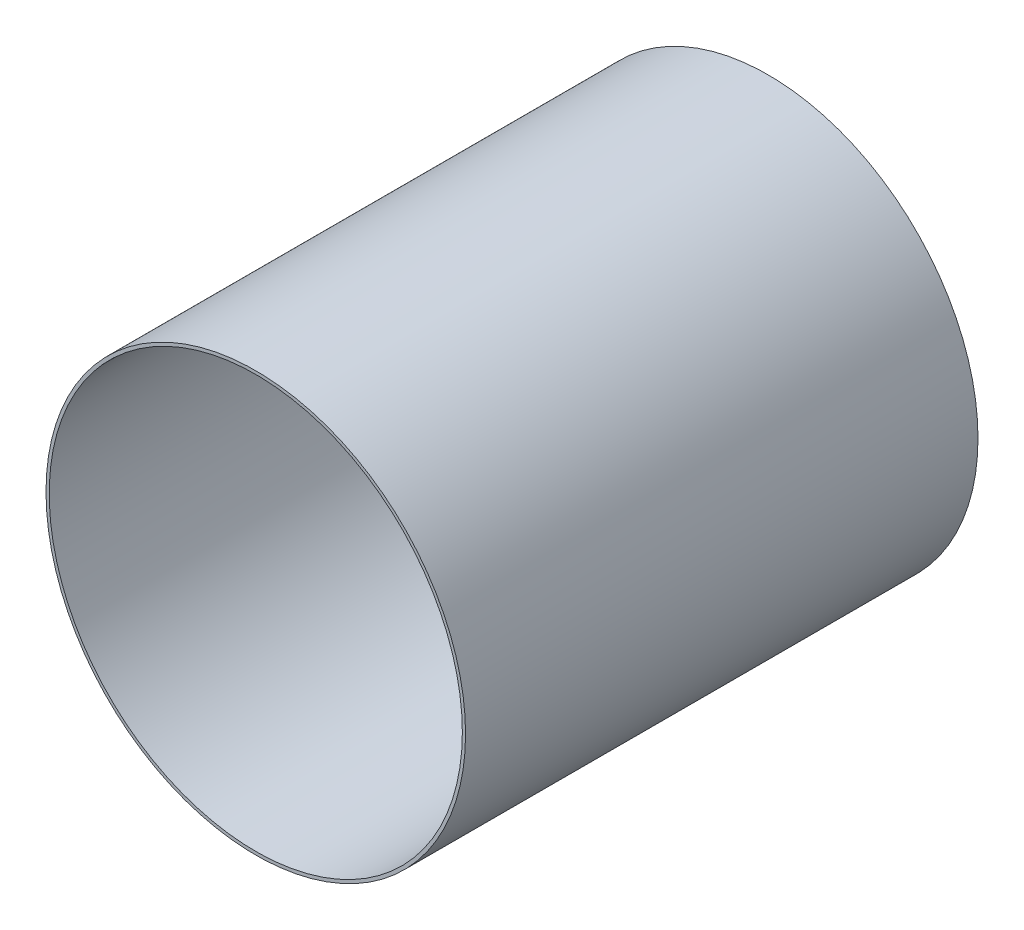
from build123d import *

# Parameters (mm, degrees)
ESBO_O1_R                = 13.1
ESBO_O1_R_2              = 12.9
RESSALTO_EXTRUS_O2_DEPTH = 31
RESSALTO_EXTRUS_O3_START = 1
ESBO_O2_R                = 13.1
RESSALTO_EXTRUS_O3_DEPTH = 1


with BuildPart() as part:
    # Esbo_o1 → Ressalto-extrus_o2 (new body)
    with BuildSketch(Plane.XY):
        Circle(ESBO_O1_R)
        Circle(ESBO_O1_R_2, mode=Mode.SUBTRACT)
    extrude(amount=RESSALTO_EXTRUS_O2_DEPTH)

    # Esbo_o2 → Ressalto-extrus_o3 (add)
    with BuildSketch(Plane(origin=(0, 0, 0), x_dir=(-1, 0, 0), z_dir=(0, 0, -1)).offset(RESSALTO_EXTRUS_O3_START)):
        Circle(ESBO_O2_R)
    extrude(amount=-RESSALTO_EXTRUS_O3_DEPTH)


solid = part.part
